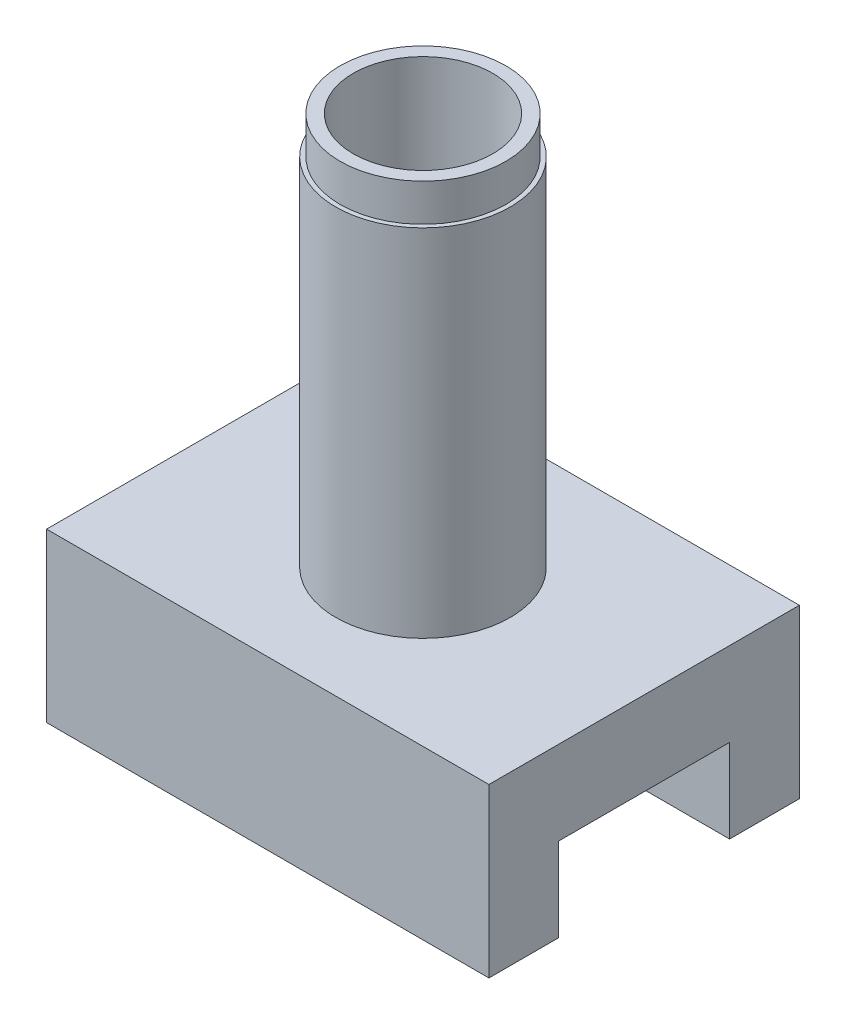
from build123d import *

# Parameters (mm, degrees)
BOSS_EXTRUDE1_DEPTH = 80.5
SKETCH2_R           = 31.75
SKETCH2_R_2         = 25.4
BOSS_EXTRUDE2_DEPTH = 143
SKETCH3_W           = 1.5875
SKETCH3_H           = 13.6
CUT_EXTRUDE1_REACH  = 201.453
SKETCH4_R           = 11.1125
SKETCH5_R           = 19.05
CUT_EXTRUDE2_DEPTH  = 13.716


with BuildPart() as part:
    # Sketch1 → Boss-Extrude1 (new, symmetric)
    with BuildSketch(Plane(origin=(0, 0, 0), x_dir=(0, 0, -1), z_dir=(1, 0, 0))):
        Polygon((-56.5, -30.48), (-31.1, -30.48), (-31.1, 0), (31.1, 0), (31.1, -30.48), (56.5, -30.48), (56.5, 30.52), (-56.5, 30.52), align=None)
    extrude(amount=BOSS_EXTRUDE1_DEPTH, both=True)

    # Sketch2 → Boss-Extrude2 (add)
    with BuildSketch(Plane(origin=(0, 30.52, 0), x_dir=(1, 0, 0), z_dir=(0, 1, 0))):
        with Locations(Location((0, 0, 0), (0, 0, 90))):
            Circle(SKETCH2_R)
        with Locations(Location((0, 0, 0), (0, 0, 270))):
            Circle(SKETCH2_R_2, mode=Mode.SUBTRACT)
    extrude(amount=BOSS_EXTRUDE2_DEPTH)

    # Sketch3 → Cut-Revolve1 (revolve, cut)
    with BuildSketch(Plane.XY, mode=Mode.PRIVATE) as cut_revolve1_sk:
        with Locations((30.95625, 166.72)):
            Rectangle(SKETCH3_W, SKETCH3_H)
    revolve(cut_revolve1_sk.sketch.rotate(Axis((0, 0, 0), (0, 1, 0)), 90), axis=Axis((0, 0, 0), (0, 1, 0)), mode=Mode.SUBTRACT)

    # Sketch4 → Cut-Extrude1 (cut, up to next)
    with BuildSketch(Plane(origin=(0, 0, 0), x_dir=(1, 0, 0), z_dir=(0, 1, 0)), mode=Mode.PRIVATE) as cut_extrude1_sk1:
        with Locations(Location((0, 0, 0), (0, 0, 90))):
            Circle(SKETCH4_R)
    cut_extrude1_tool1 = extrude(cut_extrude1_sk1.sketch, amount=CUT_EXTRUDE1_REACH, mode=Mode.PRIVATE) & part.part
    add(cut_extrude1_tool1.solids().sort_by_distance((0, 0, 0))[0], mode=Mode.SUBTRACT)

    # Sketch5 → Cut-Extrude2 (cut)
    with BuildSketch(Plane(origin=(0, 30.52, 0), x_dir=(1, 0, 0), z_dir=(0, 1, 0))):
        with Locations(Location((0, 0, 0), (0, 0, 270))):
            Circle(SKETCH5_R)
    extrude(amount=-CUT_EXTRUDE2_DEPTH, mode=Mode.SUBTRACT)


solid = part.part
